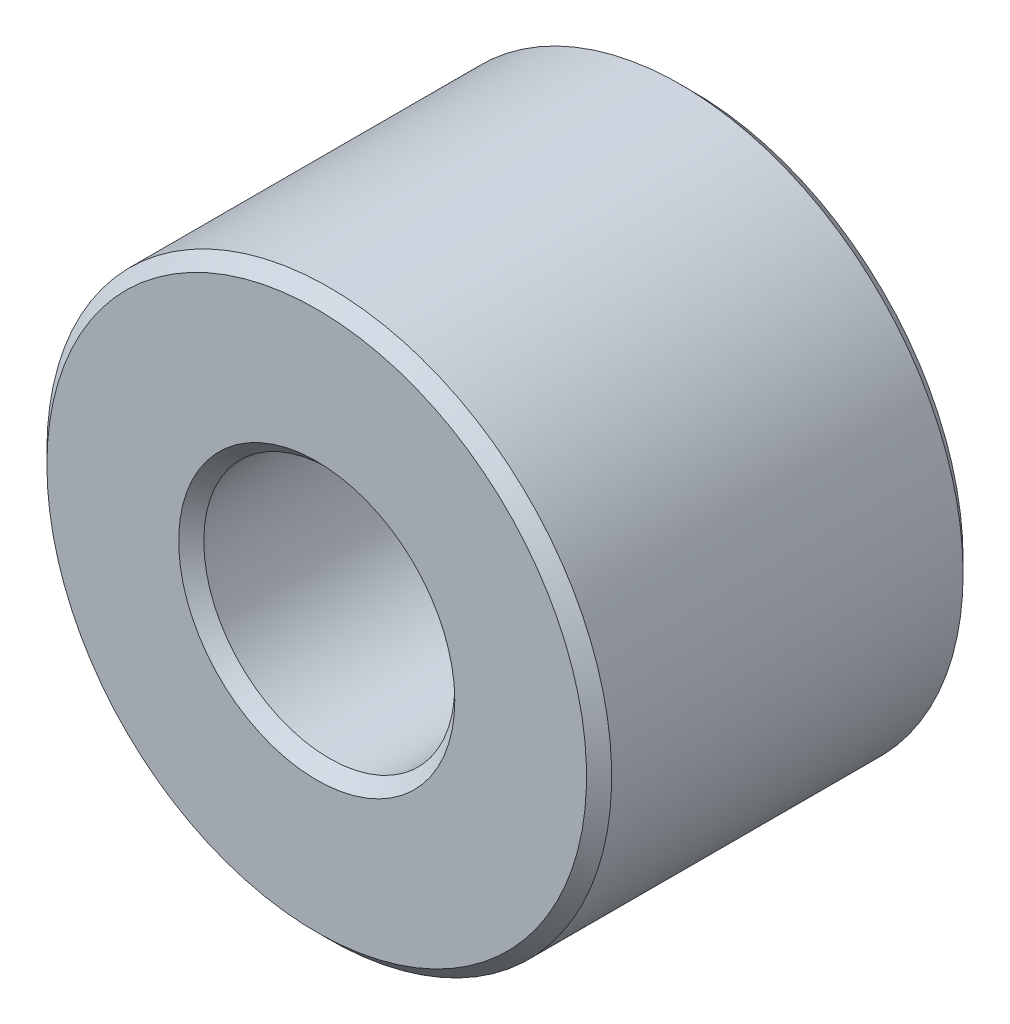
from build123d import *

# Parameters (mm, degrees)
SKETCH1_R           = 18
SKETCH1_R_2         = 8
BOSS_EXTRUDE1_DEPTH = 12
CHAMFER1_SIZE       = 0.8


with BuildPart() as part:
    # Sketch1 → Boss-Extrude1 (new, symmetric)
    with BuildSketch(Plane.XY):
        Circle(SKETCH1_R)
        Circle(SKETCH1_R_2, mode=Mode.SUBTRACT)
    extrude(amount=BOSS_EXTRUDE1_DEPTH, both=True)

    # Chamfer1
    chamfer1_edges = [part.edges().sort_by_distance(p)[0] for p in [
        (-18, 0, -12),
        (-18, 0, 12),
        (-8, 0, -12),
        (-8, 0, 12),
    ]]
    chamfer(chamfer1_edges, length=CHAMFER1_SIZE)


solid = part.part
